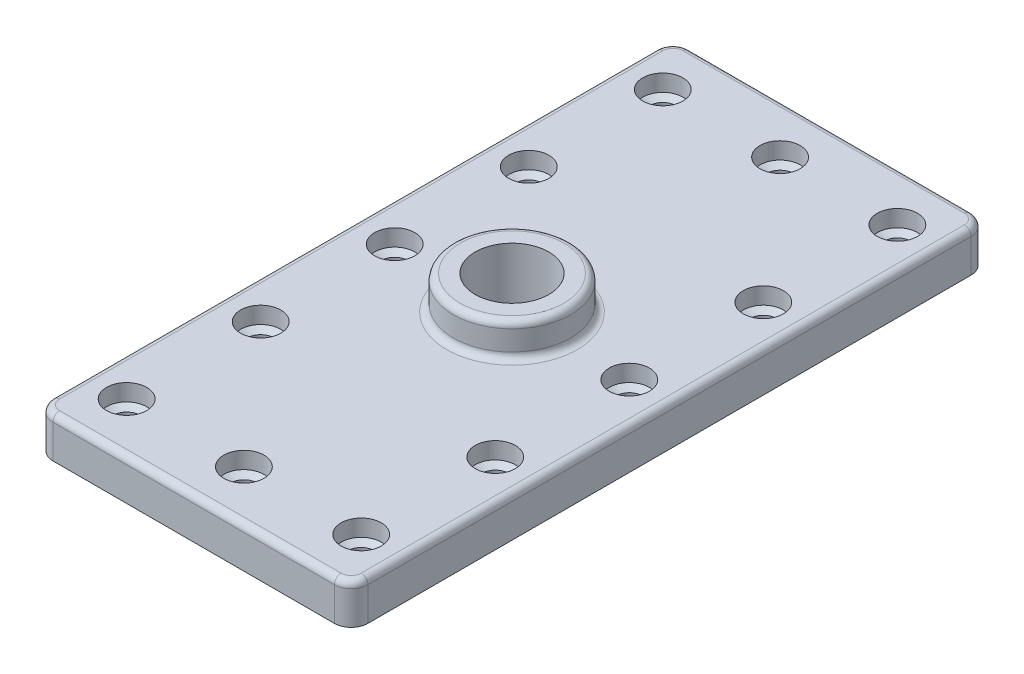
from build123d import *

# Parameters (mm, degrees)
SKETCH1_W                = 94
SKETCH1_H                = 190
PLATE_DEPTH              = 12
SKETCH2_R                = 17.5
BOSS_DEPTH               = 10
SKETCH3_R                = 11
CENTER_HOLE_DEPTH        = 109.249711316
FILLET_R5_R              = 5
FILLET_R2_R              = 2
LINEARPATTERN_COUNT      = 5
LINEARPATTERN_PITCH      = 40
LINEARPATTERN_COUNT_DIR2 = 3
LINEARPATTERN_PITCH_DIR2 = 35


with BuildPart() as part:
    # Sketch1 → plate (new body)
    with BuildSketch(Plane(origin=(0, 0, 0), x_dir=(1, 0, 0), z_dir=(0, 1, 0))):
        Rectangle(SKETCH1_W, SKETCH1_H)
    extrude(amount=PLATE_DEPTH)

    # Sketch2 → boss (add)
    with BuildSketch(Plane(origin=(0, 12, 0), x_dir=(-1, 0, 0), z_dir=(0, 1, 0))):
        with Locations(Location((0, 0, 0), (0, 0, 270))):
            Circle(SKETCH2_R)
    extrude(amount=BOSS_DEPTH)

    # Sketch3 → center hole (cut, through all)
    with BuildSketch(Plane(origin=(0, 22, 0), x_dir=(-1, 0, 0), z_dir=(0, 1, 0))):
        with Locations(Location((0, 0, 0), (0, 0, 90))):
            Circle(SKETCH3_R)
    extrude(amount=-CENTER_HOLE_DEPTH, mode=Mode.SUBTRACT)

    # Sketch4 → pattern hole (revolve, cut)
    with BuildSketch(Plane(origin=(-35, 12, 80), x_dir=(0, 0, 1), z_dir=(1, 0, 0))):
        Polygon((0, 0), (0, 12), (4, 12), (4, 6.201721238), (6, 5), (6, 0), align=None)
    pattern_hole = revolve(axis=Axis((-35, 18.130023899, 80), (0, -1, 0)), mode=Mode.SUBTRACT)

    # Fillet R5
    fillet_r5_edges = [part.edges().sort_by_distance(p)[0] for p in [
        (-47, 6, -95),
        (47, 6, -95),
        (47, 6, 95),
        (-47, 6, 95),
    ]]
    fillet(fillet_r5_edges, radius=FILLET_R5_R)

    # Fillet R2
    fillet_r2_edges = [part.edges().sort_by_distance(p)[0] for p in [
        (0, 12, 17.5),
        (0, 22, 17.5),
        (47, 12, 0),
        (0, 12, 95),
        (-47, 12, 0),
        (0, 12, -95),
        (45.535533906, 12, -93.535533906),
        (-45.535533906, 12, -93.535533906),
        (-45.535533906, 12, 93.535533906),
        (45.535533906, 12, 93.535533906),
    ]]
    fillet(fillet_r2_edges, radius=FILLET_R2_R)

    # LinearPattern: pattern hole 5 × 3, 3 skipped
    with Locations(*[(j * LINEARPATTERN_PITCH_DIR2, 0, -i * LINEARPATTERN_PITCH) for i in range(LINEARPATTERN_COUNT) for j in range(LINEARPATTERN_COUNT_DIR2) if (i, j) not in ((0, 0), (1, 1), (2, 1), (3, 1))]):
        add(pattern_hole, mode=Mode.SUBTRACT)


solid = part.part
